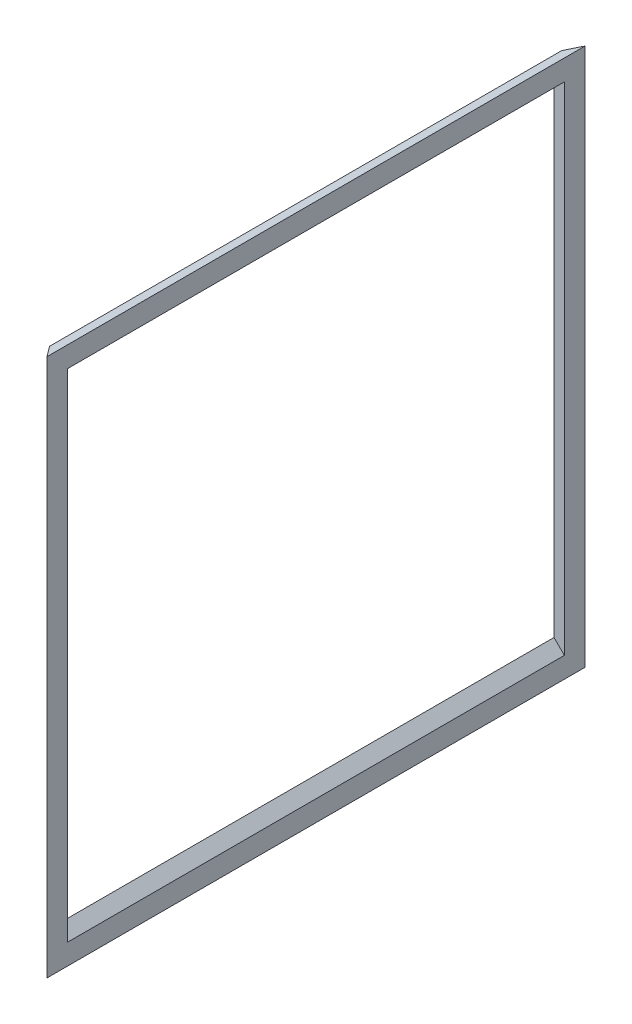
ISO-10303-21;
HEADER;
FILE_DESCRIPTION(('STEP AP214'),'2;1');
FILE_NAME('part.step','',(''),(''),'','','');
FILE_SCHEMA(('AUTOMOTIVE_DESIGN { 1 0 10303 214 1 1 1 1 }'));
ENDSEC;
DATA;
#1=APPLICATION_CONTEXT('core data for automotive mechanical design processes');
#2=APPLICATION_PROTOCOL_DEFINITION('international standard','automotive_design',2000,#1);
#3=PRODUCT_CONTEXT('',#1,'mechanical');
#4=PRODUCT('Part','Part','',(#3));
#5=PRODUCT_RELATED_PRODUCT_CATEGORY('part','',(#4));
#6=PRODUCT_DEFINITION_FORMATION('','',#4);
#7=PRODUCT_DEFINITION_CONTEXT('part definition',#1,'design');
#8=PRODUCT_DEFINITION('design','',#6,#7);
#9=PRODUCT_DEFINITION_SHAPE('','',#8);
#10=(LENGTH_UNIT() NAMED_UNIT(*) SI_UNIT(.MILLI.,.METRE.));
#11=(NAMED_UNIT(*) PLANE_ANGLE_UNIT() SI_UNIT($,.RADIAN.));
#12=(NAMED_UNIT(*) SI_UNIT($,.STERADIAN.) SOLID_ANGLE_UNIT());
#13=UNCERTAINTY_MEASURE_WITH_UNIT(LENGTH_MEASURE(1.E-05),#10,'distance_accuracy_value','');
#14=(GEOMETRIC_REPRESENTATION_CONTEXT(3) GLOBAL_UNCERTAINTY_ASSIGNED_CONTEXT((#13)) GLOBAL_UNIT_ASSIGNED_CONTEXT((#10,
#11,#12)) REPRESENTATION_CONTEXT('',''));
#15=CARTESIAN_POINT('',(0.,0.,0.));
#16=DIRECTION('',(0.,0.,1.));
#17=DIRECTION('',(1.,0.,0.));
#18=AXIS2_PLACEMENT_3D('',#15,#16,#17);
#19=CARTESIAN_POINT('',(0.,0.,76.2));
#20=DIRECTION('',(0.,0.,-1.));
#21=DIRECTION('',(-1.,0.,0.));
#22=AXIS2_PLACEMENT_3D('',#19,#20,#21);
#23=PLANE('',#22);
#24=DIRECTION('',(0.,1.,0.));
#25=VECTOR('',#24,1.);
#26=CARTESIAN_POINT('',(3.17499999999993,-82.55,76.2));
#27=LINE('',#26,#25);
#28=CARTESIAN_POINT('',(3.17499999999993,-76.2,76.2));
#29=VERTEX_POINT('',#28);
#30=CARTESIAN_POINT('',(3.17499999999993,76.2,76.2));
#31=VERTEX_POINT('',#30);
#32=EDGE_CURVE('E195',#29,#31,#27,.T.);
#33=ORIENTED_EDGE('',*,*,#32,.F.);
#34=DIRECTION('',(0.707106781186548,-0.707106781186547,0.));
#35=VECTOR('',#34,1.);
#36=CARTESIAN_POINT('',(0.,-73.025,76.2));
#37=LINE('',#36,#35);
#38=CARTESIAN_POINT('',(0.,-73.025,76.2));
#39=VERTEX_POINT('',#38);
#40=EDGE_CURVE('E176',#39,#29,#37,.T.);
#41=ORIENTED_EDGE('',*,*,#40,.F.);
#42=DIRECTION('',(0.,1.,0.));
#43=VECTOR('',#42,1.);
#44=CARTESIAN_POINT('',(0.,-75.3872,76.2));
#45=LINE('',#44,#43);
#46=CARTESIAN_POINT('',(0.,79.375,76.2));
#47=VERTEX_POINT('',#46);
#48=EDGE_CURVE('E190',#39,#47,#45,.T.);
#49=ORIENTED_EDGE('',*,*,#48,.T.);
#50=DIRECTION('',(0.707106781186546,-0.707106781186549,0.));
#51=VECTOR('',#50,1.);
#52=CARTESIAN_POINT('',(0.,79.375,76.2));
#53=LINE('',#52,#51);
#54=EDGE_CURVE('E422',#47,#31,#53,.T.);
#55=ORIENTED_EDGE('',*,*,#54,.T.);
#56=EDGE_LOOP('',(#33,#41,#49,#55));
#57=FACE_BOUND('',#56,.T.);
#58=ADVANCED_FACE('F82',(#57),#23,.T.);
#59=CARTESIAN_POINT('',(0.,0.,-76.2));
#60=DIRECTION('',(0.,0.,1.));
#61=DIRECTION('',(1.,0.,0.));
#62=AXIS2_PLACEMENT_3D('',#59,#60,#61);
#63=PLANE('',#62);
#64=DIRECTION('',(0.,-1.,0.));
#65=VECTOR('',#64,1.);
#66=CARTESIAN_POINT('',(0.,81.7372,-76.2));
#67=LINE('',#66,#65);
#68=CARTESIAN_POINT('',(0.,79.375,-76.2));
#69=VERTEX_POINT('',#68);
#70=CARTESIAN_POINT('',(0.,-73.0249999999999,-76.2));
#71=VERTEX_POINT('',#70);
#72=EDGE_CURVE('E104',#69,#71,#67,.T.);
#73=ORIENTED_EDGE('',*,*,#72,.T.);
#74=DIRECTION('',(0.707106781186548,-0.707106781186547,0.));
#75=VECTOR('',#74,1.);
#76=CARTESIAN_POINT('',(0.,-73.025,-76.2));
#77=LINE('',#76,#75);
#78=CARTESIAN_POINT('',(3.17499999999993,-76.2,-76.2));
#79=VERTEX_POINT('',#78);
#80=EDGE_CURVE('E99',#71,#79,#77,.T.);
#81=ORIENTED_EDGE('',*,*,#80,.T.);
#82=DIRECTION('',(0.,-1.,0.));
#83=VECTOR('',#82,1.);
#84=CARTESIAN_POINT('',(3.17499999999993,82.55,-76.2));
#85=LINE('',#84,#83);
#86=CARTESIAN_POINT('',(3.17499999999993,76.2,-76.2));
#87=VERTEX_POINT('',#86);
#88=EDGE_CURVE('E436',#87,#79,#85,.T.);
#89=ORIENTED_EDGE('',*,*,#88,.F.);
#90=DIRECTION('',(0.707106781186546,-0.707106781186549,0.));
#91=VECTOR('',#90,1.);
#92=CARTESIAN_POINT('',(0.,79.375,-76.2));
#93=LINE('',#92,#91);
#94=EDGE_CURVE('E431',#69,#87,#93,.T.);
#95=ORIENTED_EDGE('',*,*,#94,.F.);
#96=EDGE_LOOP('',(#73,#81,#89,#95));
#97=FACE_BOUND('',#96,.T.);
#98=ADVANCED_FACE('F566',(#97),#63,.T.);
#99=CARTESIAN_POINT('',(3.17499999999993,0.,0.));
#100=DIRECTION('',(1.,0.,0.));
#101=DIRECTION('',(0.,0.,-1.));
#102=AXIS2_PLACEMENT_3D('',#99,#100,#101);
#103=PLANE('',#102);
#104=DIRECTION('',(0.,0.,1.));
#105=VECTOR('',#104,1.);
#106=CARTESIAN_POINT('',(3.17499999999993,-76.2,-76.2));
#107=LINE('',#106,#105);
#108=EDGE_CURVE('E314',#79,#29,#107,.T.);
#109=ORIENTED_EDGE('',*,*,#108,.T.);
#110=ORIENTED_EDGE('',*,*,#32,.T.);
#111=DIRECTION('',(0.,0.,-1.));
#112=VECTOR('',#111,1.);
#113=CARTESIAN_POINT('',(3.17499999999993,76.2,76.2));
#114=LINE('',#113,#112);
#115=EDGE_CURVE('E420',#31,#87,#114,.T.);
#116=ORIENTED_EDGE('',*,*,#115,.T.);
#117=ORIENTED_EDGE('',*,*,#88,.T.);
#118=EDGE_LOOP('',(#109,#110,#116,#117));
#119=FACE_BOUND('',#118,.T.);
#120=DIRECTION('',(0.,0.,-1.));
#121=VECTOR('',#120,1.);
#122=CARTESIAN_POINT('',(3.17499999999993,-82.55,82.55));
#123=LINE('',#122,#121);
#124=CARTESIAN_POINT('',(3.17499999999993,-82.55,82.55));
#125=VERTEX_POINT('',#124);
#126=CARTESIAN_POINT('',(3.17499999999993,-82.55,76.2));
#127=VERTEX_POINT('',#126);
#128=EDGE_CURVE('E386',#125,#127,#123,.T.);
#129=ORIENTED_EDGE('',*,*,#128,.T.);
#130=DIRECTION('',(0.,0.,-1.));
#131=VECTOR('',#130,1.);
#132=CARTESIAN_POINT('',(3.17499999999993,-82.55,76.2));
#133=LINE('',#132,#131);
#134=CARTESIAN_POINT('',(3.17499999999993,-82.55,-76.2));
#135=VERTEX_POINT('',#134);
#136=EDGE_CURVE('E303',#127,#135,#133,.T.);
#137=ORIENTED_EDGE('',*,*,#136,.T.);
#138=DIRECTION('',(0.,0.,-1.));
#139=VECTOR('',#138,1.);
#140=CARTESIAN_POINT('',(3.17499999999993,-82.55,-76.2));
#141=LINE('',#140,#139);
#142=CARTESIAN_POINT('',(3.17499999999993,-82.55,-82.55));
#143=VERTEX_POINT('',#142);
#144=EDGE_CURVE('E326',#135,#143,#141,.T.);
#145=ORIENTED_EDGE('',*,*,#144,.T.);
#146=DIRECTION('',(0.,1.,0.));
#147=VECTOR('',#146,1.);
#148=CARTESIAN_POINT('',(3.17499999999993,-82.55,-82.55));
#149=LINE('',#148,#147);
#150=CARTESIAN_POINT('',(3.17499999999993,82.55,-82.55));
#151=VERTEX_POINT('',#150);
#152=EDGE_CURVE('E446',#143,#151,#149,.T.);
#153=ORIENTED_EDGE('',*,*,#152,.T.);
#154=DIRECTION('',(0.,0.,1.));
#155=VECTOR('',#154,1.);
#156=CARTESIAN_POINT('',(3.17499999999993,82.55,-82.55));
#157=LINE('',#156,#155);
#158=CARTESIAN_POINT('',(3.17499999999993,82.55,-76.2));
#159=VERTEX_POINT('',#158);
#160=EDGE_CURVE('E442',#151,#159,#157,.T.);
#161=ORIENTED_EDGE('',*,*,#160,.T.);
#162=DIRECTION('',(0.,0.,1.));
#163=VECTOR('',#162,1.);
#164=CARTESIAN_POINT('',(3.17499999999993,82.55,-76.2));
#165=LINE('',#164,#163);
#166=CARTESIAN_POINT('',(3.17499999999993,82.55,76.2));
#167=VERTEX_POINT('',#166);
#168=EDGE_CURVE('E414',#159,#167,#165,.T.);
#169=ORIENTED_EDGE('',*,*,#168,.T.);
#170=DIRECTION('',(0.,0.,1.));
#171=VECTOR('',#170,1.);
#172=CARTESIAN_POINT('',(3.17499999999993,82.55,76.2));
#173=LINE('',#172,#171);
#174=CARTESIAN_POINT('',(3.17499999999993,82.55,82.55));
#175=VERTEX_POINT('',#174);
#176=EDGE_CURVE('E95',#167,#175,#173,.T.);
#177=ORIENTED_EDGE('',*,*,#176,.T.);
#178=DIRECTION('',(0.,-1.,0.));
#179=VECTOR('',#178,1.);
#180=CARTESIAN_POINT('',(3.17499999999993,82.55,82.55));
#181=LINE('',#180,#179);
#182=EDGE_CURVE('E12',#175,#125,#181,.T.);
#183=ORIENTED_EDGE('',*,*,#182,.T.);
#184=EDGE_LOOP('',(#129,#137,#145,#153,#161,#169,#177,#183));
#185=FACE_BOUND('',#184,.T.);
#186=ADVANCED_FACE('F83',(#119,#185),#103,.T.);
#187=CARTESIAN_POINT('',(0.,0.,0.));
#188=DIRECTION('',(1.,0.,0.));
#189=DIRECTION('',(0.,0.,-1.));
#190=AXIS2_PLACEMENT_3D('',#187,#188,#189);
#191=PLANE('',#190);
#192=ORIENTED_EDGE('',*,*,#48,.F.);
#193=DIRECTION('',(0.,0.,1.));
#194=VECTOR('',#193,1.);
#195=CARTESIAN_POINT('',(0.,-73.025,-76.2));
#196=LINE('',#195,#194);
#197=EDGE_CURVE('E171',#71,#39,#196,.T.);
#198=ORIENTED_EDGE('',*,*,#197,.F.);
#199=ORIENTED_EDGE('',*,*,#72,.F.);
#200=DIRECTION('',(0.,0.,-1.));
#201=VECTOR('',#200,1.);
#202=CARTESIAN_POINT('',(0.,79.375,76.2));
#203=LINE('',#202,#201);
#204=EDGE_CURVE('E203',#47,#69,#203,.T.);
#205=ORIENTED_EDGE('',*,*,#204,.F.);
#206=EDGE_LOOP('',(#192,#198,#199,#205));
#207=FACE_BOUND('',#206,.T.);
#208=DIRECTION('',(0.,0.,-1.));
#209=VECTOR('',#208,1.);
#210=CARTESIAN_POINT('',(0.,-75.3872,78.5622));
#211=LINE('',#210,#209);
#212=CARTESIAN_POINT('',(0.,-75.3872,78.5622));
#213=VERTEX_POINT('',#212);
#214=CARTESIAN_POINT('',(0.,-75.3872,76.2));
#215=VERTEX_POINT('',#214);
#216=EDGE_CURVE('E202',#213,#215,#211,.T.);
#217=ORIENTED_EDGE('',*,*,#216,.F.);
#218=DIRECTION('',(0.,-1.,0.));
#219=VECTOR('',#218,1.);
#220=CARTESIAN_POINT('',(0.,81.7372,78.5622));
#221=LINE('',#220,#219);
#222=CARTESIAN_POINT('',(0.,81.7372,78.5622));
#223=VERTEX_POINT('',#222);
#224=EDGE_CURVE('E400',#223,#213,#221,.T.);
#225=ORIENTED_EDGE('',*,*,#224,.F.);
#226=DIRECTION('',(0.,0.,1.));
#227=VECTOR('',#226,1.);
#228=CARTESIAN_POINT('',(0.,81.7372,76.2));
#229=LINE('',#228,#227);
#230=CARTESIAN_POINT('',(0.,81.7372,76.2));
#231=VERTEX_POINT('',#230);
#232=EDGE_CURVE('E204',#231,#223,#229,.T.);
#233=ORIENTED_EDGE('',*,*,#232,.F.);
#234=DIRECTION('',(0.,0.,1.));
#235=VECTOR('',#234,1.);
#236=CARTESIAN_POINT('',(0.,81.7372,-76.2));
#237=LINE('',#236,#235);
#238=CARTESIAN_POINT('',(0.,81.7372,-76.2));
#239=VERTEX_POINT('',#238);
#240=EDGE_CURVE('E428',#239,#231,#237,.T.);
#241=ORIENTED_EDGE('',*,*,#240,.F.);
#242=DIRECTION('',(0.,0.,1.));
#243=VECTOR('',#242,1.);
#244=CARTESIAN_POINT('',(0.,81.7372,-78.5622));
#245=LINE('',#244,#243);
#246=CARTESIAN_POINT('',(0.,81.7372,-78.5622));
#247=VERTEX_POINT('',#246);
#248=EDGE_CURVE('E464',#247,#239,#245,.T.);
#249=ORIENTED_EDGE('',*,*,#248,.F.);
#250=DIRECTION('',(0.,1.,0.));
#251=VECTOR('',#250,1.);
#252=CARTESIAN_POINT('',(0.,-75.3872,-78.5622));
#253=LINE('',#252,#251);
#254=CARTESIAN_POINT('',(0.,-75.3872,-78.5622));
#255=VERTEX_POINT('',#254);
#256=EDGE_CURVE('E470',#255,#247,#253,.T.);
#257=ORIENTED_EDGE('',*,*,#256,.F.);
#258=DIRECTION('',(0.,0.,-1.));
#259=VECTOR('',#258,1.);
#260=CARTESIAN_POINT('',(0.,-75.3872,-76.2));
#261=LINE('',#260,#259);
#262=CARTESIAN_POINT('',(0.,-75.3872,-76.2));
#263=VERTEX_POINT('',#262);
#264=EDGE_CURVE('E367',#263,#255,#261,.T.);
#265=ORIENTED_EDGE('',*,*,#264,.F.);
#266=DIRECTION('',(0.,0.,-1.));
#267=VECTOR('',#266,1.);
#268=CARTESIAN_POINT('',(0.,-75.3872,76.2));
#269=LINE('',#268,#267);
#270=EDGE_CURVE('E185',#215,#263,#269,.T.);
#271=ORIENTED_EDGE('',*,*,#270,.F.);
#272=EDGE_LOOP('',(#217,#225,#233,#241,#249,#257,#265,#271));
#273=FACE_BOUND('',#272,.T.);
#274=ADVANCED_FACE('F196',(#207,#273),#191,.F.);
#275=CARTESIAN_POINT('',(-27.9288148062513,-12.3797937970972,0.));
#276=DIRECTION('',(0.914212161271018,0.405235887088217,0.));
#277=DIRECTION('',(-0.405235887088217,0.914212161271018,0.));
#278=AXIS2_PLACEMENT_3D('',#275,#276,#277);
#279=PLANE('',#278);
#280=ORIENTED_EDGE('',*,*,#216,.T.);
#281=ORIENTED_EDGE('',*,*,#270,.T.);
#282=ORIENTED_EDGE('',*,*,#264,.T.);
#283=DIRECTION('',(0.361148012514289,-0.814749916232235,-0.453601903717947));
#284=VECTOR('',#283,1.);
#285=CARTESIAN_POINT('',(0.,-75.3872,-78.5622));
#286=LINE('',#285,#284);
#287=EDGE_CURVE('E463',#255,#143,#286,.T.);
#288=ORIENTED_EDGE('',*,*,#287,.T.);
#289=ORIENTED_EDGE('',*,*,#144,.F.);
#290=ORIENTED_EDGE('',*,*,#136,.F.);
#291=ORIENTED_EDGE('',*,*,#128,.F.);
#292=DIRECTION('',(0.361148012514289,-0.814749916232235,0.453601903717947));
#293=VECTOR('',#292,1.);
#294=CARTESIAN_POINT('',(0.,-75.3872,78.5622));
#295=LINE('',#294,#293);
#296=EDGE_CURVE('E393',#213,#125,#295,.T.);
#297=ORIENTED_EDGE('',*,*,#296,.F.);
#298=EDGE_LOOP('',(#280,#281,#282,#288,#289,#290,#291,#297));
#299=FACE_BOUND('',#298,.T.);
#300=ADVANCED_FACE('F231',(#299),#279,.F.);
#301=CARTESIAN_POINT('',(-19.6377440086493,76.7099375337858,0.));
#302=DIRECTION('',(-0.248002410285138,0.968759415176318,0.));
#303=DIRECTION('',(-0.968759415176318,-0.248002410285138,0.));
#304=AXIS2_PLACEMENT_3D('',#301,#302,#303);
#305=PLANE('',#304);
#306=DIRECTION('',(0.615099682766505,0.157465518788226,0.77256520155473));
#307=VECTOR('',#306,1.);
#308=CARTESIAN_POINT('',(0.,81.7372,78.5622));
#309=LINE('',#308,#307);
#310=EDGE_CURVE('E402',#223,#175,#309,.T.);
#311=ORIENTED_EDGE('',*,*,#310,.T.);
#312=ORIENTED_EDGE('',*,*,#176,.F.);
#313=ORIENTED_EDGE('',*,*,#168,.F.);
#314=ORIENTED_EDGE('',*,*,#160,.F.);
#315=DIRECTION('',(0.615099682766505,0.157465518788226,-0.77256520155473));
#316=VECTOR('',#315,1.);
#317=CARTESIAN_POINT('',(0.,81.7372,-78.5622));
#318=LINE('',#317,#316);
#319=EDGE_CURVE('E457',#247,#151,#318,.T.);
#320=ORIENTED_EDGE('',*,*,#319,.F.);
#321=ORIENTED_EDGE('',*,*,#248,.T.);
#322=ORIENTED_EDGE('',*,*,#240,.T.);
#323=ORIENTED_EDGE('',*,*,#232,.T.);
#324=EDGE_LOOP('',(#311,#312,#313,#314,#320,#321,#322,#323));
#325=FACE_BOUND('',#324,.T.);
#326=ADVANCED_FACE('F338',(#325),#305,.T.);
#327=CARTESIAN_POINT('',(-38.282345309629,0.,30.4795742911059));
#328=DIRECTION('',(-0.782325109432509,0.,0.62287031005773));
#329=DIRECTION('',(0.62287031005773,0.,0.782325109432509));
#330=AXIS2_PLACEMENT_3D('',#327,#328,#329);
#331=PLANE('',#330);
#332=ORIENTED_EDGE('',*,*,#296,.T.);
#333=ORIENTED_EDGE('',*,*,#182,.F.);
#334=ORIENTED_EDGE('',*,*,#310,.F.);
#335=ORIENTED_EDGE('',*,*,#224,.T.);
#336=EDGE_LOOP('',(#332,#333,#334,#335));
#337=FACE_BOUND('',#336,.T.);
#338=ADVANCED_FACE('F658',(#337),#331,.T.);
#339=CARTESIAN_POINT('',(39.6875000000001,39.6874999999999,0.));
#340=DIRECTION('',(0.707106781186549,0.707106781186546,0.));
#341=DIRECTION('',(-0.707106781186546,0.707106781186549,0.));
#342=AXIS2_PLACEMENT_3D('',#339,#340,#341);
#343=PLANE('',#342);
#344=ORIENTED_EDGE('',*,*,#94,.T.);
#345=ORIENTED_EDGE('',*,*,#115,.F.);
#346=ORIENTED_EDGE('',*,*,#54,.F.);
#347=ORIENTED_EDGE('',*,*,#204,.T.);
#348=EDGE_LOOP('',(#344,#345,#346,#347));
#349=FACE_BOUND('',#348,.T.);
#350=ADVANCED_FACE('F235',(#349),#343,.F.);
#351=CARTESIAN_POINT('',(-38.282345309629,0.,-30.4795742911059));
#352=DIRECTION('',(0.782325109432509,0.,0.62287031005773));
#353=DIRECTION('',(0.62287031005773,0.,-0.782325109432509));
#354=AXIS2_PLACEMENT_3D('',#351,#352,#353);
#355=PLANE('',#354);
#356=ORIENTED_EDGE('',*,*,#319,.T.);
#357=ORIENTED_EDGE('',*,*,#152,.F.);
#358=ORIENTED_EDGE('',*,*,#287,.F.);
#359=ORIENTED_EDGE('',*,*,#256,.T.);
#360=EDGE_LOOP('',(#356,#357,#358,#359));
#361=FACE_BOUND('',#360,.T.);
#362=ADVANCED_FACE('F580',(#361),#355,.F.);
#363=CARTESIAN_POINT('',(-36.5124999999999,-36.5125,0.));
#364=DIRECTION('',(-0.707106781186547,-0.707106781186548,0.));
#365=DIRECTION('',(0.707106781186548,-0.707106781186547,0.));
#366=AXIS2_PLACEMENT_3D('',#363,#364,#365);
#367=PLANE('',#366);
#368=ORIENTED_EDGE('',*,*,#40,.T.);
#369=ORIENTED_EDGE('',*,*,#108,.F.);
#370=ORIENTED_EDGE('',*,*,#80,.F.);
#371=ORIENTED_EDGE('',*,*,#197,.T.);
#372=EDGE_LOOP('',(#368,#369,#370,#371));
#373=FACE_BOUND('',#372,.T.);
#374=ADVANCED_FACE('F173',(#373),#367,.F.);
#375=CLOSED_SHELL('',(#58,#98,#186,#274,#300,#326,#338,#350,#362,#374));
#376=MANIFOLD_SOLID_BREP('B2',#375);
#377=ADVANCED_BREP_SHAPE_REPRESENTATION('',(#18,#376),#14);
#378=SHAPE_DEFINITION_REPRESENTATION(#9,#377);
ENDSEC;
END-ISO-10303-21;
